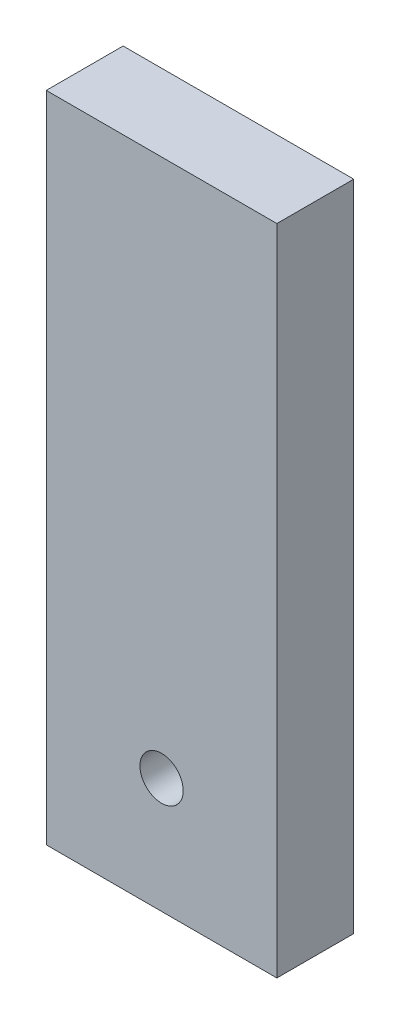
ISO-10303-21;
HEADER;
FILE_DESCRIPTION(('STEP AP214'),'2;1');
FILE_NAME('part.step','',(''),(''),'','','');
FILE_SCHEMA(('AUTOMOTIVE_DESIGN { 1 0 10303 214 1 1 1 1 }'));
ENDSEC;
DATA;
#1=APPLICATION_CONTEXT('core data for automotive mechanical design processes');
#2=APPLICATION_PROTOCOL_DEFINITION('international standard','automotive_design',2000,#1);
#3=PRODUCT_CONTEXT('',#1,'mechanical');
#4=PRODUCT('Part','Part','',(#3));
#5=PRODUCT_RELATED_PRODUCT_CATEGORY('part','',(#4));
#6=PRODUCT_DEFINITION_FORMATION('','',#4);
#7=PRODUCT_DEFINITION_CONTEXT('part definition',#1,'design');
#8=PRODUCT_DEFINITION('design','',#6,#7);
#9=PRODUCT_DEFINITION_SHAPE('','',#8);
#10=(LENGTH_UNIT() NAMED_UNIT(*) SI_UNIT(.MILLI.,.METRE.));
#11=(NAMED_UNIT(*) PLANE_ANGLE_UNIT() SI_UNIT($,.RADIAN.));
#12=(NAMED_UNIT(*) SI_UNIT($,.STERADIAN.) SOLID_ANGLE_UNIT());
#13=UNCERTAINTY_MEASURE_WITH_UNIT(LENGTH_MEASURE(1.E-05),#10,'distance_accuracy_value','');
#14=(GEOMETRIC_REPRESENTATION_CONTEXT(3) GLOBAL_UNCERTAINTY_ASSIGNED_CONTEXT((#13)) GLOBAL_UNIT_ASSIGNED_CONTEXT((#10,
#11,#12)) REPRESENTATION_CONTEXT('',''));
#15=CARTESIAN_POINT('',(0.,0.,0.));
#16=DIRECTION('',(0.,0.,1.));
#17=DIRECTION('',(1.,0.,0.));
#18=AXIS2_PLACEMENT_3D('',#15,#16,#17);
#19=CARTESIAN_POINT('',(-61.0027132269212,431.8,-25.7145653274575));
#20=DIRECTION('',(1.,0.,0.));
#21=DIRECTION('',(0.,0.,-1.));
#22=AXIS2_PLACEMENT_3D('',#19,#20,#21);
#23=PLANE('',#22);
#24=DIRECTION('',(0.,0.,1.));
#25=VECTOR('',#24,1.);
#26=CARTESIAN_POINT('',(-61.0027132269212,0.,-25.7145653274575));
#27=LINE('',#26,#25);
#28=CARTESIAN_POINT('',(-61.0027132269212,0.,-25.7145653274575));
#29=VERTEX_POINT('',#28);
#30=CARTESIAN_POINT('',(-61.0027132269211,0.,25.0854346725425));
#31=VERTEX_POINT('',#30);
#32=EDGE_CURVE('E95',#29,#31,#27,.T.);
#33=ORIENTED_EDGE('',*,*,#32,.T.);
#34=DIRECTION('',(0.,-1.,0.));
#35=VECTOR('',#34,1.);
#36=CARTESIAN_POINT('',(-61.0027132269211,431.8,25.0854346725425));
#37=LINE('',#36,#35);
#38=CARTESIAN_POINT('',(-61.0027132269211,431.8,25.0854346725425));
#39=VERTEX_POINT('',#38);
#40=EDGE_CURVE('E11',#39,#31,#37,.T.);
#41=ORIENTED_EDGE('',*,*,#40,.F.);
#42=DIRECTION('',(0.,0.,1.));
#43=VECTOR('',#42,1.);
#44=CARTESIAN_POINT('',(-61.0027132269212,431.8,-25.7145653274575));
#45=LINE('',#44,#43);
#46=CARTESIAN_POINT('',(-61.0027132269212,431.8,-25.7145653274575));
#47=VERTEX_POINT('',#46);
#48=EDGE_CURVE('E83',#47,#39,#45,.T.);
#49=ORIENTED_EDGE('',*,*,#48,.F.);
#50=DIRECTION('',(0.,-1.,0.));
#51=VECTOR('',#50,1.);
#52=CARTESIAN_POINT('',(-61.0027132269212,431.8,-25.7145653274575));
#53=LINE('',#52,#51);
#54=EDGE_CURVE('E91',#47,#29,#53,.T.);
#55=ORIENTED_EDGE('',*,*,#54,.T.);
#56=EDGE_LOOP('',(#33,#41,#49,#55));
#57=FACE_BOUND('',#56,.T.);
#58=ADVANCED_FACE('F32',(#57),#23,.F.);
#59=CARTESIAN_POINT('',(-61.0027132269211,431.8,25.0854346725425));
#60=DIRECTION('',(0.,0.,-1.));
#61=DIRECTION('',(-1.,0.,0.));
#62=AXIS2_PLACEMENT_3D('',#59,#60,#61);
#63=PLANE('',#62);
#64=CARTESIAN_POINT('',(15.1972867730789,76.2,25.0854346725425));
#65=DIRECTION('',(0.,0.,1.));
#66=DIRECTION('',(1.,0.,0.));
#67=AXIS2_PLACEMENT_3D('',#64,#65,#66);
#68=CIRCLE('',#67,14.2875);
#69=CARTESIAN_POINT('',(29.4847867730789,76.2,25.0854346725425));
#70=VERTEX_POINT('',#69);
#71=EDGE_CURVE('E111',#70,#70,#68,.T.);
#72=ORIENTED_EDGE('',*,*,#71,.F.);
#73=EDGE_LOOP('',(#72));
#74=FACE_BOUND('',#73,.T.);
#75=DIRECTION('',(1.,0.,0.));
#76=VECTOR('',#75,1.);
#77=CARTESIAN_POINT('',(-61.0027132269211,0.,25.0854346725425));
#78=LINE('',#77,#76);
#79=CARTESIAN_POINT('',(91.3972867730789,0.,25.0854346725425));
#80=VERTEX_POINT('',#79);
#81=EDGE_CURVE('E87',#31,#80,#78,.T.);
#82=ORIENTED_EDGE('',*,*,#81,.T.);
#83=DIRECTION('',(0.,-1.,0.));
#84=VECTOR('',#83,1.);
#85=CARTESIAN_POINT('',(91.3972867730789,431.8,25.0854346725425));
#86=LINE('',#85,#84);
#87=CARTESIAN_POINT('',(91.3972867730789,431.8,25.0854346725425));
#88=VERTEX_POINT('',#87);
#89=EDGE_CURVE('E40',#88,#80,#86,.T.);
#90=ORIENTED_EDGE('',*,*,#89,.F.);
#91=DIRECTION('',(1.,0.,0.));
#92=VECTOR('',#91,1.);
#93=CARTESIAN_POINT('',(-61.0027132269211,431.8,25.0854346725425));
#94=LINE('',#93,#92);
#95=EDGE_CURVE('E78',#39,#88,#94,.T.);
#96=ORIENTED_EDGE('',*,*,#95,.F.);
#97=ORIENTED_EDGE('',*,*,#40,.T.);
#98=EDGE_LOOP('',(#82,#90,#96,#97));
#99=FACE_BOUND('',#98,.T.);
#100=ADVANCED_FACE('F86',(#74,#99),#63,.F.);
#101=CARTESIAN_POINT('',(91.3972867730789,431.8,-25.7145653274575));
#102=DIRECTION('',(-1.,0.,0.));
#103=DIRECTION('',(0.,0.,1.));
#104=AXIS2_PLACEMENT_3D('',#101,#102,#103);
#105=PLANE('',#104);
#106=DIRECTION('',(0.,0.,-1.));
#107=VECTOR('',#106,1.);
#108=CARTESIAN_POINT('',(91.3972867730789,0.,-25.7145653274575));
#109=LINE('',#108,#107);
#110=CARTESIAN_POINT('',(91.3972867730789,0.,-25.7145653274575));
#111=VERTEX_POINT('',#110);
#112=EDGE_CURVE('E65',#80,#111,#109,.T.);
#113=ORIENTED_EDGE('',*,*,#112,.T.);
#114=DIRECTION('',(0.,-1.,0.));
#115=VECTOR('',#114,1.);
#116=CARTESIAN_POINT('',(91.3972867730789,431.8,-25.7145653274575));
#117=LINE('',#116,#115);
#118=CARTESIAN_POINT('',(91.3972867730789,431.8,-25.7145653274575));
#119=VERTEX_POINT('',#118);
#120=EDGE_CURVE('E88',#119,#111,#117,.T.);
#121=ORIENTED_EDGE('',*,*,#120,.F.);
#122=DIRECTION('',(0.,0.,-1.));
#123=VECTOR('',#122,1.);
#124=CARTESIAN_POINT('',(91.3972867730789,431.8,-25.7145653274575));
#125=LINE('',#124,#123);
#126=EDGE_CURVE('E81',#88,#119,#125,.T.);
#127=ORIENTED_EDGE('',*,*,#126,.F.);
#128=ORIENTED_EDGE('',*,*,#89,.T.);
#129=EDGE_LOOP('',(#113,#121,#127,#128));
#130=FACE_BOUND('',#129,.T.);
#131=ADVANCED_FACE('F89',(#130),#105,.F.);
#132=CARTESIAN_POINT('',(-61.0027132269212,431.8,-25.7145653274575));
#133=DIRECTION('',(0.,0.,1.));
#134=DIRECTION('',(1.,0.,0.));
#135=AXIS2_PLACEMENT_3D('',#132,#133,#134);
#136=PLANE('',#135);
#137=CARTESIAN_POINT('',(15.1972867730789,76.2,-25.7145653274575));
#138=DIRECTION('',(0.,0.,1.));
#139=DIRECTION('',(1.,0.,0.));
#140=AXIS2_PLACEMENT_3D('',#137,#138,#139);
#141=CIRCLE('',#140,14.2875);
#142=CARTESIAN_POINT('',(29.4847867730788,76.2,-25.7145653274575));
#143=VERTEX_POINT('',#142);
#144=EDGE_CURVE('E98',#143,#143,#141,.T.);
#145=ORIENTED_EDGE('',*,*,#144,.T.);
#146=EDGE_LOOP('',(#145));
#147=FACE_BOUND('',#146,.T.);
#148=DIRECTION('',(-1.,0.,0.));
#149=VECTOR('',#148,1.);
#150=CARTESIAN_POINT('',(-61.0027132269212,0.,-25.7145653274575));
#151=LINE('',#150,#149);
#152=EDGE_CURVE('E71',#111,#29,#151,.T.);
#153=ORIENTED_EDGE('',*,*,#152,.T.);
#154=ORIENTED_EDGE('',*,*,#54,.F.);
#155=DIRECTION('',(-1.,0.,0.));
#156=VECTOR('',#155,1.);
#157=CARTESIAN_POINT('',(-61.0027132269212,431.8,-25.7145653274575));
#158=LINE('',#157,#156);
#159=EDGE_CURVE('E48',#119,#47,#158,.T.);
#160=ORIENTED_EDGE('',*,*,#159,.F.);
#161=ORIENTED_EDGE('',*,*,#120,.T.);
#162=EDGE_LOOP('',(#153,#154,#160,#161));
#163=FACE_BOUND('',#162,.T.);
#164=ADVANCED_FACE('F103',(#147,#163),#136,.F.);
#165=CARTESIAN_POINT('',(0.,431.8,0.));
#166=DIRECTION('',(0.,1.,0.));
#167=DIRECTION('',(0.,0.,1.));
#168=AXIS2_PLACEMENT_3D('',#165,#166,#167);
#169=PLANE('',#168);
#170=ORIENTED_EDGE('',*,*,#48,.T.);
#171=ORIENTED_EDGE('',*,*,#95,.T.);
#172=ORIENTED_EDGE('',*,*,#126,.T.);
#173=ORIENTED_EDGE('',*,*,#159,.T.);
#174=EDGE_LOOP('',(#170,#171,#172,#173));
#175=FACE_BOUND('',#174,.T.);
#176=ADVANCED_FACE('F79',(#175),#169,.T.);
#177=CARTESIAN_POINT('',(0.,0.,0.));
#178=DIRECTION('',(0.,1.,0.));
#179=DIRECTION('',(0.,0.,1.));
#180=AXIS2_PLACEMENT_3D('',#177,#178,#179);
#181=PLANE('',#180);
#182=ORIENTED_EDGE('',*,*,#32,.F.);
#183=ORIENTED_EDGE('',*,*,#152,.F.);
#184=ORIENTED_EDGE('',*,*,#112,.F.);
#185=ORIENTED_EDGE('',*,*,#81,.F.);
#186=EDGE_LOOP('',(#182,#183,#184,#185));
#187=FACE_BOUND('',#186,.T.);
#188=ADVANCED_FACE('F106',(#187),#181,.F.);
#189=CARTESIAN_POINT('',(15.1972867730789,76.2,25.0854346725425));
#190=DIRECTION('',(0.,0.,1.));
#191=DIRECTION('',(1.,0.,0.));
#192=AXIS2_PLACEMENT_3D('',#189,#190,#191);
#193=CYLINDRICAL_SURFACE('',#192,14.2875);
#194=ORIENTED_EDGE('',*,*,#144,.F.);
#195=EDGE_LOOP('',(#194));
#196=FACE_BOUND('',#195,.T.);
#197=ORIENTED_EDGE('',*,*,#71,.T.);
#198=EDGE_LOOP('',(#197));
#199=FACE_BOUND('',#198,.T.);
#200=ADVANCED_FACE('F115',(#196,#199),#193,.F.);
#201=CLOSED_SHELL('',(#58,#100,#131,#164,#176,#188,#200));
#202=MANIFOLD_SOLID_BREP('B2',#201);
#203=ADVANCED_BREP_SHAPE_REPRESENTATION('',(#18,#202),#14);
#204=SHAPE_DEFINITION_REPRESENTATION(#9,#203);
ENDSEC;
END-ISO-10303-21;
